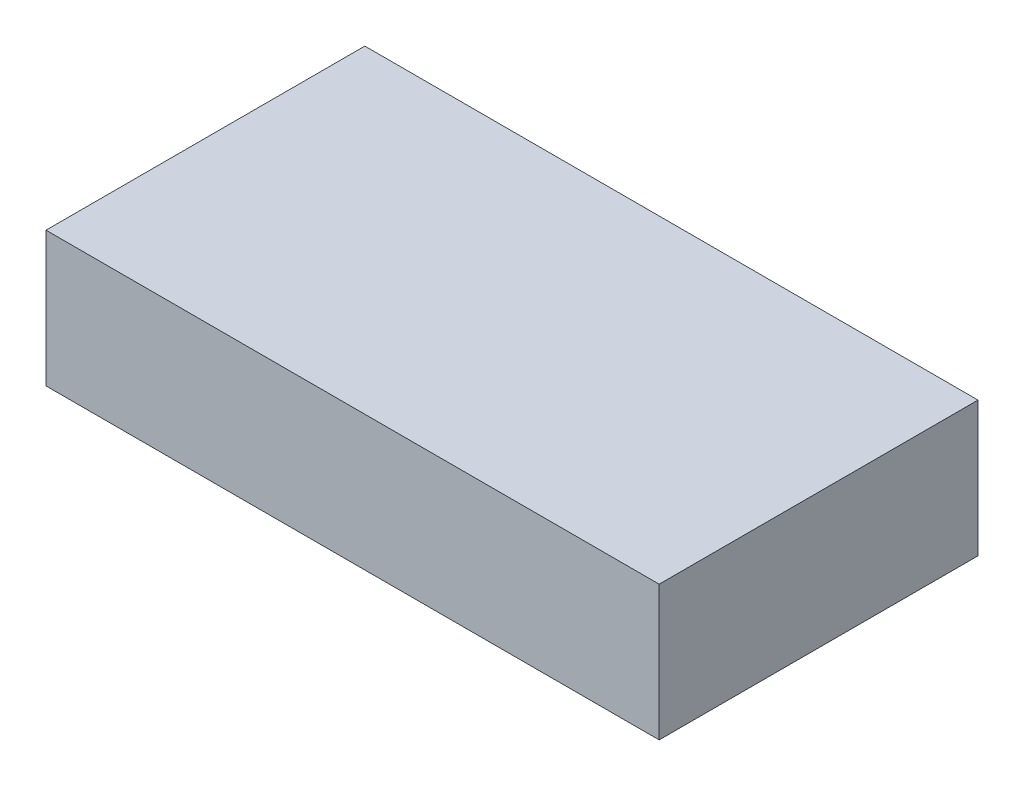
ISO-10303-21;
HEADER;
FILE_DESCRIPTION(('STEP AP214'),'2;1');
FILE_NAME('part.step','',(''),(''),'','','');
FILE_SCHEMA(('AUTOMOTIVE_DESIGN { 1 0 10303 214 1 1 1 1 }'));
ENDSEC;
DATA;
#1=APPLICATION_CONTEXT('core data for automotive mechanical design processes');
#2=APPLICATION_PROTOCOL_DEFINITION('international standard','automotive_design',2000,#1);
#3=PRODUCT_CONTEXT('',#1,'mechanical');
#4=PRODUCT('Part','Part','',(#3));
#5=PRODUCT_RELATED_PRODUCT_CATEGORY('part','',(#4));
#6=PRODUCT_DEFINITION_FORMATION('','',#4);
#7=PRODUCT_DEFINITION_CONTEXT('part definition',#1,'design');
#8=PRODUCT_DEFINITION('design','',#6,#7);
#9=PRODUCT_DEFINITION_SHAPE('','',#8);
#10=(LENGTH_UNIT() NAMED_UNIT(*) SI_UNIT(.MILLI.,.METRE.));
#11=(NAMED_UNIT(*) PLANE_ANGLE_UNIT() SI_UNIT($,.RADIAN.));
#12=(NAMED_UNIT(*) SI_UNIT($,.STERADIAN.) SOLID_ANGLE_UNIT());
#13=UNCERTAINTY_MEASURE_WITH_UNIT(LENGTH_MEASURE(1.E-05),#10,'distance_accuracy_value','');
#14=(GEOMETRIC_REPRESENTATION_CONTEXT(3) GLOBAL_UNCERTAINTY_ASSIGNED_CONTEXT((#13)) GLOBAL_UNIT_ASSIGNED_CONTEXT((#10,
#11,#12)) REPRESENTATION_CONTEXT('',''));
#15=CARTESIAN_POINT('',(0.,0.,0.));
#16=DIRECTION('',(0.,0.,1.));
#17=DIRECTION('',(1.,0.,0.));
#18=AXIS2_PLACEMENT_3D('',#15,#16,#17);
#19=CARTESIAN_POINT('',(0.,27.94,0.));
#20=DIRECTION('',(1.,0.,0.));
#21=DIRECTION('',(0.,0.,-1.));
#22=AXIS2_PLACEMENT_3D('',#19,#20,#21);
#23=PLANE('',#22);
#24=DIRECTION('',(0.,0.,1.));
#25=VECTOR('',#24,1.);
#26=CARTESIAN_POINT('',(0.,0.,0.));
#27=LINE('',#26,#25);
#28=CARTESIAN_POINT('',(0.,0.,-66.04));
#29=VERTEX_POINT('',#28);
#30=CARTESIAN_POINT('',(0.,0.,0.));
#31=VERTEX_POINT('',#30);
#32=EDGE_CURVE('E96',#29,#31,#27,.T.);
#33=ORIENTED_EDGE('',*,*,#32,.T.);
#34=DIRECTION('',(0.,-1.,0.));
#35=VECTOR('',#34,1.);
#36=CARTESIAN_POINT('',(0.,27.94,0.));
#37=LINE('',#36,#35);
#38=CARTESIAN_POINT('',(0.,27.94,0.));
#39=VERTEX_POINT('',#38);
#40=EDGE_CURVE('E11',#39,#31,#37,.T.);
#41=ORIENTED_EDGE('',*,*,#40,.F.);
#42=DIRECTION('',(0.,0.,1.));
#43=VECTOR('',#42,1.);
#44=CARTESIAN_POINT('',(0.,27.94,0.));
#45=LINE('',#44,#43);
#46=CARTESIAN_POINT('',(0.,27.94,-66.04));
#47=VERTEX_POINT('',#46);
#48=EDGE_CURVE('E84',#47,#39,#45,.T.);
#49=ORIENTED_EDGE('',*,*,#48,.F.);
#50=DIRECTION('',(0.,-1.,0.));
#51=VECTOR('',#50,1.);
#52=CARTESIAN_POINT('',(0.,27.94,-66.04));
#53=LINE('',#52,#51);
#54=EDGE_CURVE('E92',#47,#29,#53,.T.);
#55=ORIENTED_EDGE('',*,*,#54,.T.);
#56=EDGE_LOOP('',(#33,#41,#49,#55));
#57=FACE_BOUND('',#56,.T.);
#58=ADVANCED_FACE('F33',(#57),#23,.F.);
#59=CARTESIAN_POINT('',(0.,27.94,0.));
#60=DIRECTION('',(0.,0.,-1.));
#61=DIRECTION('',(-1.,0.,0.));
#62=AXIS2_PLACEMENT_3D('',#59,#60,#61);
#63=PLANE('',#62);
#64=DIRECTION('',(1.,0.,0.));
#65=VECTOR('',#64,1.);
#66=CARTESIAN_POINT('',(0.,0.,0.));
#67=LINE('',#66,#65);
#68=CARTESIAN_POINT('',(127.,0.,0.));
#69=VERTEX_POINT('',#68);
#70=EDGE_CURVE('E88',#31,#69,#67,.T.);
#71=ORIENTED_EDGE('',*,*,#70,.T.);
#72=DIRECTION('',(0.,-1.,0.));
#73=VECTOR('',#72,1.);
#74=CARTESIAN_POINT('',(127.,27.94,0.));
#75=LINE('',#74,#73);
#76=CARTESIAN_POINT('',(127.,27.94,0.));
#77=VERTEX_POINT('',#76);
#78=EDGE_CURVE('E41',#77,#69,#75,.T.);
#79=ORIENTED_EDGE('',*,*,#78,.F.);
#80=DIRECTION('',(1.,0.,0.));
#81=VECTOR('',#80,1.);
#82=CARTESIAN_POINT('',(0.,27.94,0.));
#83=LINE('',#82,#81);
#84=EDGE_CURVE('E79',#39,#77,#83,.T.);
#85=ORIENTED_EDGE('',*,*,#84,.F.);
#86=ORIENTED_EDGE('',*,*,#40,.T.);
#87=EDGE_LOOP('',(#71,#79,#85,#86));
#88=FACE_BOUND('',#87,.T.);
#89=ADVANCED_FACE('F87',(#88),#63,.F.);
#90=CARTESIAN_POINT('',(127.,27.94,0.));
#91=DIRECTION('',(-1.,0.,0.));
#92=DIRECTION('',(0.,0.,1.));
#93=AXIS2_PLACEMENT_3D('',#90,#91,#92);
#94=PLANE('',#93);
#95=DIRECTION('',(0.,0.,-1.));
#96=VECTOR('',#95,1.);
#97=CARTESIAN_POINT('',(127.,0.,0.));
#98=LINE('',#97,#96);
#99=CARTESIAN_POINT('',(127.,0.,-66.04));
#100=VERTEX_POINT('',#99);
#101=EDGE_CURVE('E66',#69,#100,#98,.T.);
#102=ORIENTED_EDGE('',*,*,#101,.T.);
#103=DIRECTION('',(0.,-1.,0.));
#104=VECTOR('',#103,1.);
#105=CARTESIAN_POINT('',(127.,27.94,-66.04));
#106=LINE('',#105,#104);
#107=CARTESIAN_POINT('',(127.,27.94,-66.04));
#108=VERTEX_POINT('',#107);
#109=EDGE_CURVE('E89',#108,#100,#106,.T.);
#110=ORIENTED_EDGE('',*,*,#109,.F.);
#111=DIRECTION('',(0.,0.,-1.));
#112=VECTOR('',#111,1.);
#113=CARTESIAN_POINT('',(127.,27.94,0.));
#114=LINE('',#113,#112);
#115=EDGE_CURVE('E82',#77,#108,#114,.T.);
#116=ORIENTED_EDGE('',*,*,#115,.F.);
#117=ORIENTED_EDGE('',*,*,#78,.T.);
#118=EDGE_LOOP('',(#102,#110,#116,#117));
#119=FACE_BOUND('',#118,.T.);
#120=ADVANCED_FACE('F90',(#119),#94,.F.);
#121=CARTESIAN_POINT('',(0.,27.94,-66.04));
#122=DIRECTION('',(0.,0.,1.));
#123=DIRECTION('',(1.,0.,0.));
#124=AXIS2_PLACEMENT_3D('',#121,#122,#123);
#125=PLANE('',#124);
#126=DIRECTION('',(-1.,0.,0.));
#127=VECTOR('',#126,1.);
#128=CARTESIAN_POINT('',(0.,0.,-66.04));
#129=LINE('',#128,#127);
#130=EDGE_CURVE('E72',#100,#29,#129,.T.);
#131=ORIENTED_EDGE('',*,*,#130,.T.);
#132=ORIENTED_EDGE('',*,*,#54,.F.);
#133=DIRECTION('',(-1.,0.,0.));
#134=VECTOR('',#133,1.);
#135=CARTESIAN_POINT('',(0.,27.94,-66.04));
#136=LINE('',#135,#134);
#137=EDGE_CURVE('E49',#108,#47,#136,.T.);
#138=ORIENTED_EDGE('',*,*,#137,.F.);
#139=ORIENTED_EDGE('',*,*,#109,.T.);
#140=EDGE_LOOP('',(#131,#132,#138,#139));
#141=FACE_BOUND('',#140,.T.);
#142=ADVANCED_FACE('F103',(#141),#125,.F.);
#143=CARTESIAN_POINT('',(0.,27.94,0.));
#144=DIRECTION('',(0.,-1.,0.));
#145=DIRECTION('',(0.,0.,-1.));
#146=AXIS2_PLACEMENT_3D('',#143,#144,#145);
#147=PLANE('',#146);
#148=ORIENTED_EDGE('',*,*,#48,.T.);
#149=ORIENTED_EDGE('',*,*,#84,.T.);
#150=ORIENTED_EDGE('',*,*,#115,.T.);
#151=ORIENTED_EDGE('',*,*,#137,.T.);
#152=EDGE_LOOP('',(#148,#149,#150,#151));
#153=FACE_BOUND('',#152,.T.);
#154=ADVANCED_FACE('F80',(#153),#147,.F.);
#155=CARTESIAN_POINT('',(0.,0.,0.));
#156=DIRECTION('',(0.,-1.,0.));
#157=DIRECTION('',(0.,0.,-1.));
#158=AXIS2_PLACEMENT_3D('',#155,#156,#157);
#159=PLANE('',#158);
#160=ORIENTED_EDGE('',*,*,#32,.F.);
#161=ORIENTED_EDGE('',*,*,#130,.F.);
#162=ORIENTED_EDGE('',*,*,#101,.F.);
#163=ORIENTED_EDGE('',*,*,#70,.F.);
#164=EDGE_LOOP('',(#160,#161,#162,#163));
#165=FACE_BOUND('',#164,.T.);
#166=ADVANCED_FACE('F106',(#165),#159,.T.);
#167=CLOSED_SHELL('',(#58,#89,#120,#142,#154,#166));
#168=MANIFOLD_SOLID_BREP('B2',#167);
#169=ADVANCED_BREP_SHAPE_REPRESENTATION('',(#18,#168),#14);
#170=SHAPE_DEFINITION_REPRESENTATION(#9,#169);
ENDSEC;
END-ISO-10303-21;
